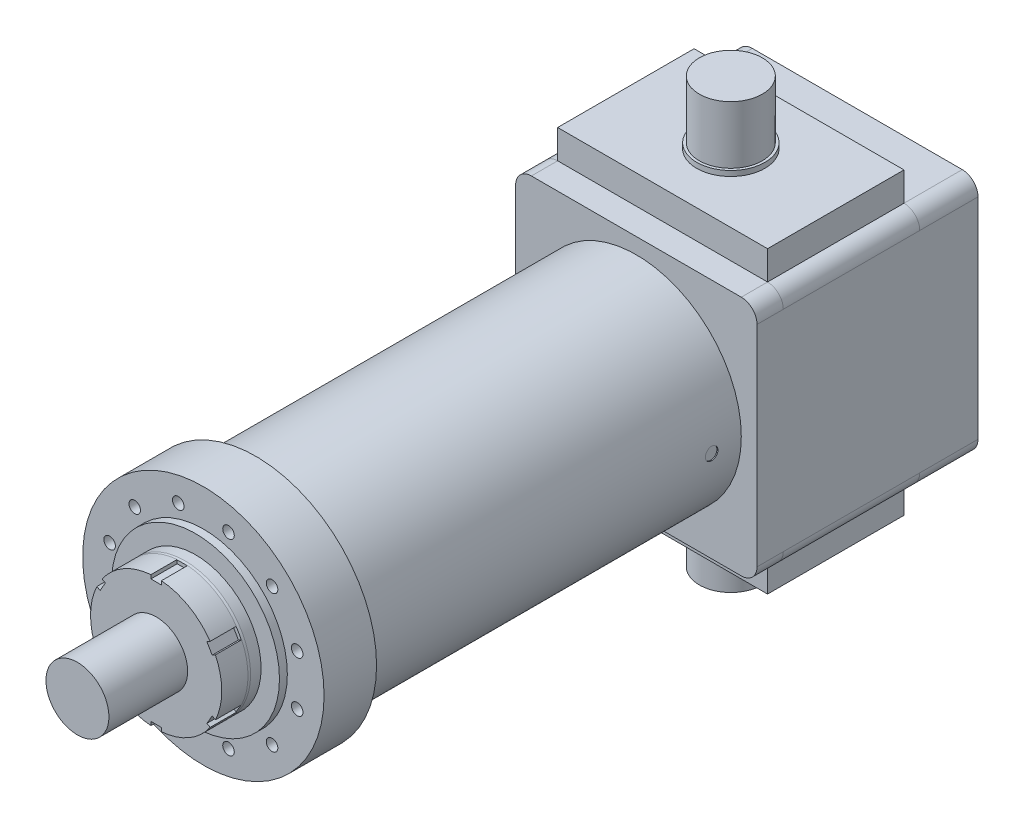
from build123d import *

# Parameters (mm, degrees)
SKETCH_1_R          = 200
EXTRUDE_1_DEPTH     = 725
SKETCH_2_R          = 230
SKETCH_2_R_2        = 11
EXTRUDE_2_DEPTH     = 100
SKETCH_3_R          = 160
EXTRUDE_3_DEPTH     = 15
SKETCH_4_R          = 125
EXTRUDE_4_DEPTH     = 25
CHAMFER_1_SIZE      = 5
CHAMFER_1_SIZE2     = 0.881634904
SKETCH_6_W          = 460
SKETCH_6_H          = 460
EXTRUDE_6_DEPTH     = 50
SKETCH_9_R          = 12
CUT_EXTRUDE_2_DEPTH = 2
SKETCH_10_R         = 12
CUT_EXTRUDE_3_DEPTH = 2
EXTRUDE_7_DEPTH     = 50
SKETCH_11_R         = 60
EXTRUDE_8_DEPTH     = 150
SKETCH_16_W         = 460
SKETCH_16_H         = 460
EXTRUDE_12_DEPTH    = 260
SKETCH_17_W         = 460
SKETCH_17_H         = 460
EXTRUDE_13_DEPTH    = 111
FILLET_2_R          = 30
SKETCH_19_W         = 400
SKETCH_19_H         = 260
EXTRUDE_14_DEPTH    = 55
EXTRUDE_START       = -460
SKETCH_19_2_W       = 400
SKETCH_19_2_H       = 260
EXTRUDE_15_DEPTH    = 55
FILLET_3_R          = 30
SKETCH_20_R         = 60
EXTRUDE_16_DEPTH    = 120
EXTRUDE_START_2     = -690
SKETCH_20_2_R       = 60
EXTRUDE_17_DEPTH    = 120
SKETCH_21_R         = 65
SKETCH_21_R_2       = 60
EXTRUDE_18_DEPTH    = 10
EXTRUDE_START_3     = -580
SKETCH_21_2_R       = 65
SKETCH_21_2_R_2     = 60
EXTRUDE_19_DEPTH    = 10


with BuildPart() as part:
    # Sketch 1 → Extrude 1 (new body)
    with BuildSketch(Plane.XY):
        Circle(SKETCH_1_R)
    extrude(amount=EXTRUDE_1_DEPTH)

    # Sketch 2 → Extrude 2 (add)
    with BuildSketch(Plane.XY.offset(725)):
        Circle(SKETCH_2_R)
        with Locations((178.696277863, 47.881523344)):
            Circle(SKETCH_2_R_2, mode=Mode.SUBTRACT)
        with Locations((178.696277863, -47.881523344)):
            Circle(SKETCH_2_R_2, mode=Mode.SUBTRACT)
        with Locations((130.81475452, -130.81475452)):
            Circle(SKETCH_2_R_2, mode=Mode.SUBTRACT)
        with Locations((47.881523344, -178.696277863)):
            Circle(SKETCH_2_R_2, mode=Mode.SUBTRACT)
        with Locations((-47.881523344, -178.696277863)):
            Circle(SKETCH_2_R_2, mode=Mode.SUBTRACT)
        with Locations((-130.81475452, -130.81475452)):
            Circle(SKETCH_2_R_2, mode=Mode.SUBTRACT)
        with Locations((-178.696277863, -47.881523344)):
            Circle(SKETCH_2_R_2, mode=Mode.SUBTRACT)
        with Locations((-178.696277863, 47.881523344)):
            Circle(SKETCH_2_R_2, mode=Mode.SUBTRACT)
        with Locations((-130.81475452, 130.814754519)):
            Circle(SKETCH_2_R_2, mode=Mode.SUBTRACT)
        with Locations((-47.881523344, 178.696277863)):
            Circle(SKETCH_2_R_2, mode=Mode.SUBTRACT)
        with Locations((47.881523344, 178.696277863)):
            Circle(SKETCH_2_R_2, mode=Mode.SUBTRACT)
        with Locations((130.81475452, 130.81475452)):
            Circle(SKETCH_2_R_2, mode=Mode.SUBTRACT)
    extrude(amount=EXTRUDE_2_DEPTH)

    # Sketch 3 → Extrude 3 (add)
    with BuildSketch(Plane.XY.offset(825)):
        Circle(SKETCH_3_R)
    extrude(amount=EXTRUDE_3_DEPTH)

    # Sketch 4 → Extrude 4 (add)
    with BuildSketch(Plane.XY.offset(840)):
        Circle(SKETCH_4_R)
    extrude(amount=EXTRUDE_4_DEPTH)

    # Chamfer 1
    chamfer_1_edges = [part.edges().sort_by_distance(p)[0] for p in [
        (-125, 0, 865),
    ]]
    chamfer_1_side = [part.faces().sort_by_distance(p)[0] for p in [
        (-125, 0, 852.5),
    ]]
    chamfer(chamfer_1_edges, length=CHAMFER_1_SIZE, length2=CHAMFER_1_SIZE2, reference=chamfer_1_side[0])

    # Sketch 6 → Extrude 6 (add)
    with BuildSketch(Plane(origin=(0, 0, 0), x_dir=(-1, 0, 0), z_dir=(0, 0, -1))):
        Rectangle(SKETCH_6_W, SKETCH_6_H)
    extrude(amount=EXTRUDE_6_DEPTH)

    # Sketch 9 → Cut-Extrude 2 (cut)
    with BuildSketch(Plane(origin=(-200, 0, 0), x_dir=(0, 0, -1), z_dir=(1, 0, 0))):
        with Locations(Location((-36.5, 0, 0), (0, 0, 180))):
            Circle(SKETCH_9_R)
        with Locations(Location((-670.5, 0, 0), (0, 0, 180))):
            Circle(SKETCH_9_R)
    extrude(amount=CUT_EXTRUDE_2_DEPTH, mode=Mode.SUBTRACT)

    # Sketch 10 → Cut-Extrude 3 (cut)
    with BuildSketch(Plane(origin=(200, 0, 0), x_dir=(0, 0, -1), z_dir=(1, 0, 0))):
        with Locations((-56.5, 0)):
            Circle(SKETCH_10_R)
    extrude(amount=-CUT_EXTRUDE_3_DEPTH, mode=Mode.SUBTRACT)

    # Sketch 5 → Extrude 7 (add)
    with BuildSketch(Plane.XY.offset(865)):
        with BuildLine():
            Line((-10, 124.599357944), (-10, 117.5))
            Line((-10, 117.5), (10, 117.5))
            Line((10, 117.5), (10, 124.599357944))
            ThreePointArc((10, 124.599357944), (62.5, 108.253175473), (102.906209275, 70.95993301))
            Line((102.906209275, 70.95993301), (96.757984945, 67.410254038))
            Line((96.757984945, 67.410254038), (106.757984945, 50.089745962))
            Line((106.757984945, 50.089745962), (112.906209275, 53.639424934))
            ThreePointArc((112.906209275, 53.639424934), (125, 0), (112.906209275, -53.639424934))
            Line((112.906209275, -53.639424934), (106.757984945, -50.089745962))
            Line((106.757984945, -50.089745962), (96.757984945, -67.410254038))
            Line((96.757984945, -67.410254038), (102.906209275, -70.95993301))
            ThreePointArc((102.906209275, -70.95993301), (62.5, -108.253175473), (10, -124.599357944))
            Line((10, -124.599357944), (10, -117.5))
            Line((10, -117.5), (-10, -117.5))
            Line((-10, -117.5), (-10, -124.599357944))
            ThreePointArc((-10, -124.599357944), (-62.5, -108.253175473), (-102.906209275, -70.95993301))
            Line((-102.906209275, -70.95993301), (-96.757984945, -67.410254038))
            Line((-96.757984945, -67.410254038), (-106.757984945, -50.089745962))
            Line((-106.757984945, -50.089745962), (-112.906209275, -53.639424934))
            ThreePointArc((-112.906209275, -53.639424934), (-125, 0), (-112.906209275, 53.639424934))
            Line((-112.906209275, 53.639424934), (-106.757984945, 50.089745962))
            Line((-106.757984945, 50.089745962), (-96.757984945, 67.410254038))
            Line((-96.757984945, 67.410254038), (-102.906209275, 70.95993301))
            ThreePointArc((-102.906209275, 70.95993301), (-62.5, 108.253175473), (-10, 124.599357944))
        make_face()
    extrude(amount=EXTRUDE_7_DEPTH)

    # Sketch 11 → Extrude 8 (add)
    with BuildSketch(Plane.XY.offset(915)):
        Circle(SKETCH_11_R)
    extrude(amount=EXTRUDE_8_DEPTH)



with BuildPart() as body_2:
    # Sketch 16 → Extrude 12 (new body)
    with BuildSketch(Plane(origin=(0, 0, -50), x_dir=(-1, 0, 0), z_dir=(0, 0, -1))):
        Rectangle(SKETCH_16_W, SKETCH_16_H)
    extrude(amount=EXTRUDE_12_DEPTH)

    # Fillet 2
    fillet_2_edges = [body_2.edges().sort_by_distance(p)[0] for p in [
        (-230, -230, -180),
        (230, -230, -180),
        (230, 230, -180),
        (-230, 230, -180),
    ]]
    fillet(fillet_2_edges, radius=FILLET_2_R)


with BuildPart() as body_3:
    # Sketch 17 → Extrude 13 (new body)
    with BuildSketch(Plane(origin=(0, 0, -310), x_dir=(-1, 0, 0), z_dir=(0, 0, -1))):
        Rectangle(SKETCH_17_W, SKETCH_17_H)
    extrude(amount=EXTRUDE_13_DEPTH)


with BuildPart() as part_1:
    add(part.part)

    add(body_2.part)  # Extrude 14 merges body 2

    add(body_3.part)  # Extrude 14 merges body 3
    # Sketch 19 → Extrude 14 (add)
    with BuildSketch(Plane.XZ.offset(230)):
        with Locations((0, -180)):
            Rectangle(SKETCH_19_W, SKETCH_19_H)
    extrude(amount=EXTRUDE_14_DEPTH)

    # Sketch 19_2 → Extrude 15 (add)
    with BuildSketch(Plane.XZ.offset(230).offset(EXTRUDE_START)):
        with Locations((0, -180)):
            Rectangle(SKETCH_19_2_W, SKETCH_19_2_H)
    extrude(amount=-EXTRUDE_15_DEPTH)

    # Fillet 3
    fillet_3_edges = [part_1.edges().sort_by_distance(p)[0] for p in [
        (230, 230, -25),
        (230, 230, -365.5),
        (-230, 230, -365.5),
        (-230, 230, -25),
        (230, -230, -25),
        (230, -230, -365.5),
        (-230, -230, -25),
        (-230, -230, -365.5),
    ]]
    fillet(fillet_3_edges, radius=FILLET_3_R)

    # Sketch 20 → Extrude 16 (add)
    with BuildSketch(Plane.XZ.offset(285)):
        with Locations(Location((0, -180, 0), (0, 0, 270))):
            Circle(SKETCH_20_R)
    extrude(amount=EXTRUDE_16_DEPTH)

    # Sketch 20_2 → Extrude 17 (add)
    with BuildSketch(Plane.XZ.offset(285).offset(EXTRUDE_START_2)):
        with Locations(Location((0, -180, 0), (0, 0, 270))):
            Circle(SKETCH_20_2_R)
    extrude(amount=EXTRUDE_17_DEPTH)

    # Sketch 21 → Extrude 18 (add)
    with BuildSketch(Plane.XZ.offset(285)):
        with Locations(Location((0, -180, 0), (0, 0, 90))):
            Circle(SKETCH_21_R)
        with Locations(Location((0, -180, 0), (0, 0, 270))):
            Circle(SKETCH_21_R_2, mode=Mode.SUBTRACT)
    extrude(amount=EXTRUDE_18_DEPTH)

    # Sketch 21_2 → Extrude 19 (add)
    with BuildSketch(Plane.XZ.offset(285).offset(EXTRUDE_START_3)):
        with Locations(Location((0, -180, 0), (0, 0, 90))):
            Circle(SKETCH_21_2_R)
        with Locations(Location((0, -180, 0), (0, 0, 270))):
            Circle(SKETCH_21_2_R_2, mode=Mode.SUBTRACT)
    extrude(amount=EXTRUDE_19_DEPTH)


solid = part_1.part
